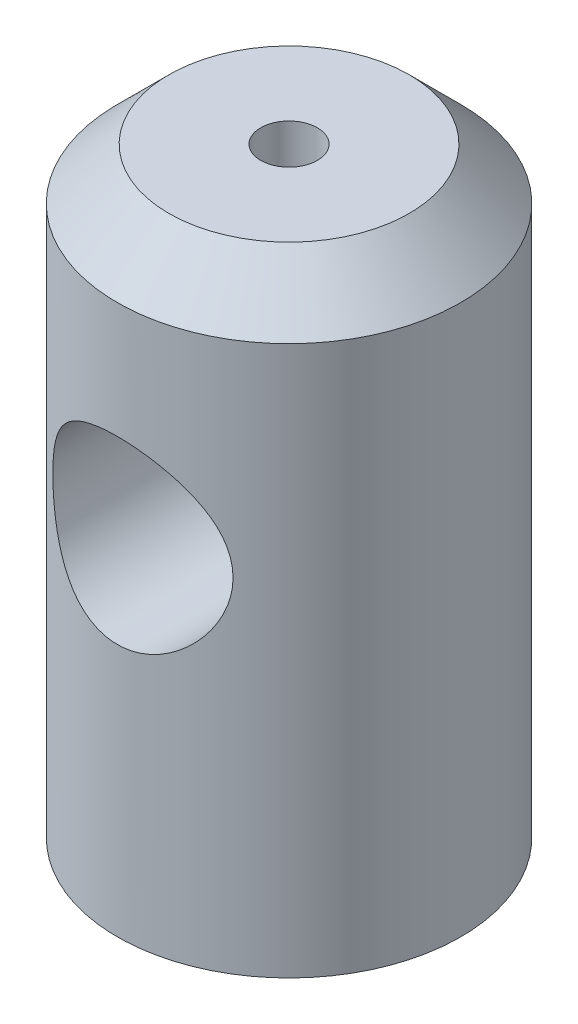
from build123d import *

# Parameters (mm, degrees)
M4_TAPPED_HOLE1_D = 3.3
SKETCH3_R         = 5.25
EXTRUDE1_DEPTH    = 20


with BuildPart() as part:
    # Sketch1 → Revolve1 (revolve)
    with BuildSketch(Plane.XY, mode=Mode.PRIVATE) as revolve1_sk:
        Polygon((7, 35), (10, 32), (10, 0), (0, 0), (0, 35), align=None)
    revolve(revolve1_sk.sketch.rotate(Axis((0, 0, 0), (0, 1, 0)), 90), axis=Axis((0, 0, 0), (0, 1, 0)))

    # M4 Tapped Hole1 (through all)
    with Locations(Plane.ZX.offset(35)):
        with Locations((0, 0)):
            Hole(M4_TAPPED_HOLE1_D / 2)

    # Sketch3 → Extrude1 (cut, symmetric)
    with BuildSketch(Plane.XY):
        with Locations((0, 20)):
            Circle(SKETCH3_R)
    extrude(amount=EXTRUDE1_DEPTH, both=True, mode=Mode.SUBTRACT)


solid = part.part
